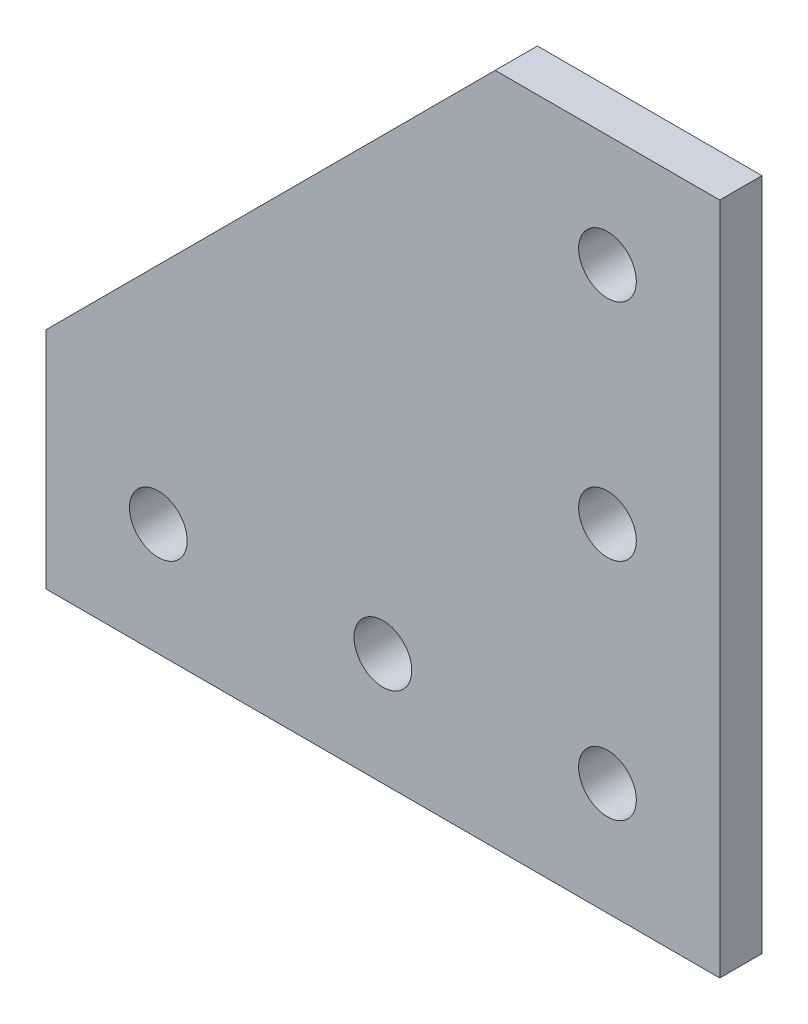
from build123d import *

# Parameters (mm, degrees)
SKETCH1_R           = 3.2639
BOSS_EXTRUDE1_DEPTH = 4.7752


with BuildPart() as part:
    # Sketch1 → Boss-Extrude1 (new body)
    with BuildSketch(Plane.XY):
        Polygon((-38.1, 0), (38.1, 0), (38.1, 76.2), (12.7, 76.2), (-38.1, 25.4), align=None)
        with Locations((25.4, 63.5)):
            Circle(SKETCH1_R, mode=Mode.SUBTRACT)
        with Locations((25.4, 38.1)):
            Circle(SKETCH1_R, mode=Mode.SUBTRACT)
        with Locations((25.4, 12.7)):
            Circle(SKETCH1_R, mode=Mode.SUBTRACT)
        with Locations((0, 12.7)):
            Circle(SKETCH1_R, mode=Mode.SUBTRACT)
        with Locations((-25.4, 12.7)):
            Circle(SKETCH1_R, mode=Mode.SUBTRACT)
    extrude(amount=BOSS_EXTRUDE1_DEPTH)


solid = part.part
